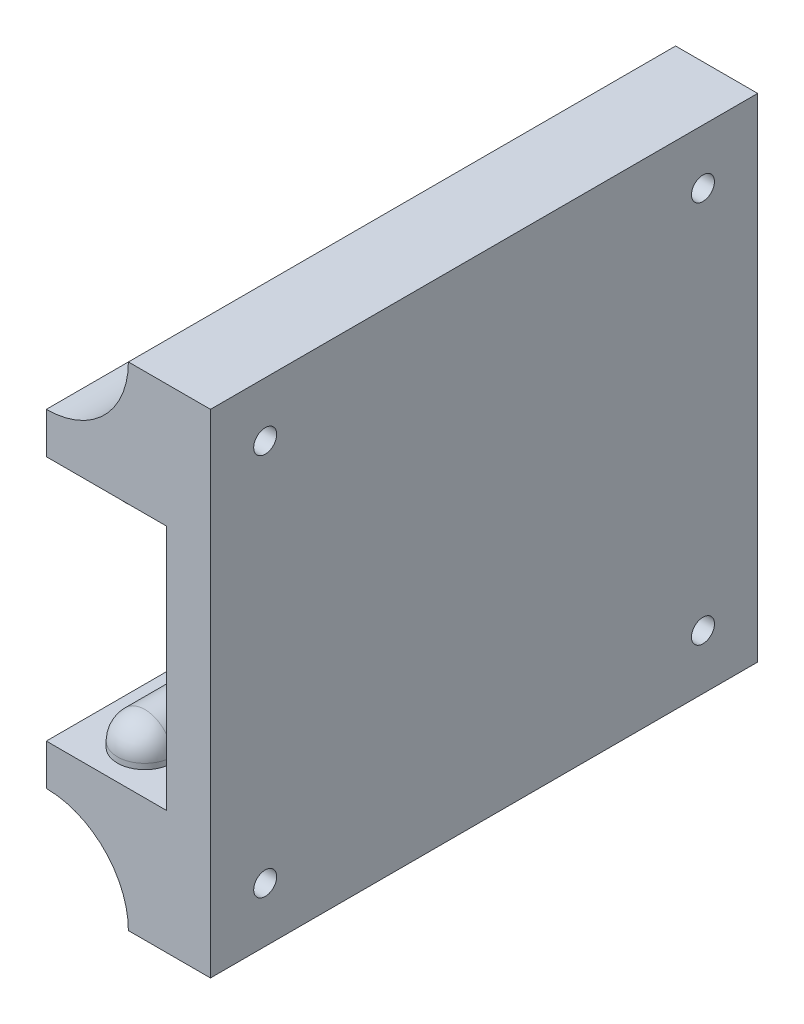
ISO-10303-21;
HEADER;
FILE_DESCRIPTION(('STEP AP214'),'2;1');
FILE_NAME('part.step','',(''),(''),'','','');
FILE_SCHEMA(('AUTOMOTIVE_DESIGN { 1 0 10303 214 1 1 1 1 }'));
ENDSEC;
DATA;
#1=APPLICATION_CONTEXT('core data for automotive mechanical design processes');
#2=APPLICATION_PROTOCOL_DEFINITION('international standard','automotive_design',2000,#1);
#3=PRODUCT_CONTEXT('',#1,'mechanical');
#4=PRODUCT('Part','Part','',(#3));
#5=PRODUCT_RELATED_PRODUCT_CATEGORY('part','',(#4));
#6=PRODUCT_DEFINITION_FORMATION('','',#4);
#7=PRODUCT_DEFINITION_CONTEXT('part definition',#1,'design');
#8=PRODUCT_DEFINITION('design','',#6,#7);
#9=PRODUCT_DEFINITION_SHAPE('','',#8);
#10=(LENGTH_UNIT() NAMED_UNIT(*) SI_UNIT(.MILLI.,.METRE.));
#11=(NAMED_UNIT(*) PLANE_ANGLE_UNIT() SI_UNIT($,.RADIAN.));
#12=(NAMED_UNIT(*) SI_UNIT($,.STERADIAN.) SOLID_ANGLE_UNIT());
#13=UNCERTAINTY_MEASURE_WITH_UNIT(LENGTH_MEASURE(1.E-05),#10,'distance_accuracy_value','');
#14=(GEOMETRIC_REPRESENTATION_CONTEXT(3) GLOBAL_UNCERTAINTY_ASSIGNED_CONTEXT((#13)) GLOBAL_UNIT_ASSIGNED_CONTEXT((#10,
#11,#12)) REPRESENTATION_CONTEXT('',''));
#15=CARTESIAN_POINT('',(0.,0.,0.));
#16=DIRECTION('',(0.,0.,1.));
#17=DIRECTION('',(1.,0.,0.));
#18=AXIS2_PLACEMENT_3D('',#15,#16,#17);
#19=CARTESIAN_POINT('',(0.,21.5000000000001,50.));
#20=DIRECTION('',(0.,0.,-1.));
#21=DIRECTION('',(-1.,0.,0.));
#22=AXIS2_PLACEMENT_3D('',#19,#20,#21);
#23=CYLINDRICAL_SURFACE('',#22,5.);
#24=CARTESIAN_POINT('',(0.,21.5000000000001,42.));
#25=DIRECTION('',(0.,0.707106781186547,-0.707106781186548));
#26=DIRECTION('',(0.,-0.707106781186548,-0.707106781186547));
#27=AXIS2_PLACEMENT_3D('',#24,#25,#26);
#28=ELLIPSE('',#27,7.07106781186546,4.99999999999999);
#29=CARTESIAN_POINT('',(4.99999999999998,21.5000000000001,41.9999999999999));
#30=VERTEX_POINT('',#29);
#31=CARTESIAN_POINT('',(4.89897948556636,22.5,42.9999999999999));
#32=VERTEX_POINT('',#31);
#33=EDGE_CURVE('E537',#30,#32,#28,.F.);
#34=ORIENTED_EDGE('',*,*,#33,.F.);
#35=CARTESIAN_POINT('',(0.,21.5000000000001,42.));
#36=DIRECTION('',(0.,0.,-1.));
#37=DIRECTION('',(1.,0.,0.));
#38=AXIS2_PLACEMENT_3D('',#35,#36,#37);
#39=CIRCLE('',#38,4.99999999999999);
#40=CARTESIAN_POINT('',(-4.99999999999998,21.5000000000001,41.9999999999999));
#41=VERTEX_POINT('',#40);
#42=EDGE_CURVE('E515',#30,#41,#39,.T.);
#43=ORIENTED_EDGE('',*,*,#42,.T.);
#44=CARTESIAN_POINT('',(-4.89897948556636,22.5,42.9999999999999));
#45=VERTEX_POINT('',#44);
#46=EDGE_CURVE('E535',#45,#41,#28,.F.);
#47=ORIENTED_EDGE('',*,*,#46,.F.);
#48=DIRECTION('',(0.,0.,-1.));
#49=VECTOR('',#48,1.);
#50=CARTESIAN_POINT('',(-4.89897948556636,22.5,50.));
#51=LINE('',#50,#49);
#52=CARTESIAN_POINT('',(-4.89897948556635,22.5,-43.));
#53=VERTEX_POINT('',#52);
#54=EDGE_CURVE('E632',#45,#53,#51,.T.);
#55=ORIENTED_EDGE('',*,*,#54,.T.);
#56=CARTESIAN_POINT('',(0.,21.5000000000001,-41.9999999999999));
#57=DIRECTION('',(0.,-0.707106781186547,-0.707106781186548));
#58=DIRECTION('',(0.,0.707106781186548,-0.707106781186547));
#59=AXIS2_PLACEMENT_3D('',#56,#57,#58);
#60=ELLIPSE('',#59,7.07106781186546,4.99999999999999);
#61=CARTESIAN_POINT('',(-4.99999999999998,21.5000000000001,-41.9999999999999));
#62=VERTEX_POINT('',#61);
#63=EDGE_CURVE('E560',#62,#53,#60,.T.);
#64=ORIENTED_EDGE('',*,*,#63,.F.);
#65=CARTESIAN_POINT('',(0.,21.5000000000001,-41.9999999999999));
#66=DIRECTION('',(0.,0.,-1.));
#67=DIRECTION('',(1.,0.,0.));
#68=AXIS2_PLACEMENT_3D('',#65,#66,#67);
#69=CIRCLE('',#68,4.99999999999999);
#70=CARTESIAN_POINT('',(4.99999999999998,21.5000000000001,-41.9999999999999));
#71=VERTEX_POINT('',#70);
#72=EDGE_CURVE('E538',#71,#62,#69,.T.);
#73=ORIENTED_EDGE('',*,*,#72,.F.);
#74=CARTESIAN_POINT('',(4.89897948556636,22.5,-43.));
#75=VERTEX_POINT('',#74);
#76=EDGE_CURVE('E558',#75,#71,#60,.T.);
#77=ORIENTED_EDGE('',*,*,#76,.F.);
#78=DIRECTION('',(0.,0.,-1.));
#79=VECTOR('',#78,1.);
#80=CARTESIAN_POINT('',(4.89897948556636,22.5,50.));
#81=LINE('',#80,#79);
#82=EDGE_CURVE('E630',#32,#75,#81,.T.);
#83=ORIENTED_EDGE('',*,*,#82,.F.);
#84=EDGE_LOOP('',(#34,#43,#47,#55,#64,#73,#77,#83));
#85=FACE_BOUND('',#84,.T.);
#86=ADVANCED_FACE('F348',(#85),#23,.T.);
#87=CARTESIAN_POINT('',(0.,-21.5000000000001,50.));
#88=DIRECTION('',(0.,0.,-1.));
#89=DIRECTION('',(-1.,0.,0.));
#90=AXIS2_PLACEMENT_3D('',#87,#88,#89);
#91=CYLINDRICAL_SURFACE('',#90,5.);
#92=CARTESIAN_POINT('',(0.,-21.5000000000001,42.));
#93=DIRECTION('',(0.,-0.707106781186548,-0.707106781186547));
#94=DIRECTION('',(0.,0.707106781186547,-0.707106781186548));
#95=AXIS2_PLACEMENT_3D('',#92,#93,#94);
#96=ELLIPSE('',#95,7.07106781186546,4.99999999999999);
#97=CARTESIAN_POINT('',(-4.99999999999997,-21.5000000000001,41.9999999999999));
#98=VERTEX_POINT('',#97);
#99=CARTESIAN_POINT('',(-4.89897948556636,-22.5,42.9999999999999));
#100=VERTEX_POINT('',#99);
#101=EDGE_CURVE('E534',#98,#100,#96,.F.);
#102=ORIENTED_EDGE('',*,*,#101,.F.);
#103=CARTESIAN_POINT('',(0.,-21.5000000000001,42.));
#104=DIRECTION('',(0.,0.,-1.));
#105=DIRECTION('',(-1.,0.,0.));
#106=AXIS2_PLACEMENT_3D('',#103,#104,#105);
#107=CIRCLE('',#106,4.99999999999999);
#108=CARTESIAN_POINT('',(4.99999999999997,-21.5000000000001,41.9999999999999));
#109=VERTEX_POINT('',#108);
#110=EDGE_CURVE('E518',#98,#109,#107,.T.);
#111=ORIENTED_EDGE('',*,*,#110,.T.);
#112=CARTESIAN_POINT('',(4.89897948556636,-22.5,42.9999999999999));
#113=VERTEX_POINT('',#112);
#114=EDGE_CURVE('E532',#113,#109,#96,.F.);
#115=ORIENTED_EDGE('',*,*,#114,.F.);
#116=DIRECTION('',(0.,0.,-1.));
#117=VECTOR('',#116,1.);
#118=CARTESIAN_POINT('',(4.89897948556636,-22.5,50.));
#119=LINE('',#118,#117);
#120=CARTESIAN_POINT('',(4.89897948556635,-22.5,-43.));
#121=VERTEX_POINT('',#120);
#122=EDGE_CURVE('E622',#113,#121,#119,.T.);
#123=ORIENTED_EDGE('',*,*,#122,.T.);
#124=CARTESIAN_POINT('',(0.,-21.5000000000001,-41.9999999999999));
#125=DIRECTION('',(0.,0.707106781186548,-0.707106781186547));
#126=DIRECTION('',(0.,-0.707106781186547,-0.707106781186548));
#127=AXIS2_PLACEMENT_3D('',#124,#125,#126);
#128=ELLIPSE('',#127,7.07106781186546,4.99999999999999);
#129=CARTESIAN_POINT('',(4.99999999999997,-21.5000000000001,-41.9999999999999));
#130=VERTEX_POINT('',#129);
#131=EDGE_CURVE('E557',#130,#121,#128,.T.);
#132=ORIENTED_EDGE('',*,*,#131,.F.);
#133=CARTESIAN_POINT('',(0.,-21.5000000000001,-41.9999999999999));
#134=DIRECTION('',(0.,0.,-1.));
#135=DIRECTION('',(-1.,0.,0.));
#136=AXIS2_PLACEMENT_3D('',#133,#134,#135);
#137=CIRCLE('',#136,4.99999999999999);
#138=CARTESIAN_POINT('',(-4.99999999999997,-21.5000000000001,-41.9999999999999));
#139=VERTEX_POINT('',#138);
#140=EDGE_CURVE('E540',#139,#130,#137,.T.);
#141=ORIENTED_EDGE('',*,*,#140,.F.);
#142=CARTESIAN_POINT('',(-4.89897948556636,-22.5,-42.9999999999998));
#143=VERTEX_POINT('',#142);
#144=EDGE_CURVE('E555',#143,#139,#128,.T.);
#145=ORIENTED_EDGE('',*,*,#144,.F.);
#146=DIRECTION('',(0.,0.,-1.));
#147=VECTOR('',#146,1.);
#148=CARTESIAN_POINT('',(-4.89897948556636,-22.5,50.));
#149=LINE('',#148,#147);
#150=EDGE_CURVE('E620',#100,#143,#149,.T.);
#151=ORIENTED_EDGE('',*,*,#150,.F.);
#152=EDGE_LOOP('',(#102,#111,#115,#123,#132,#141,#145,#151));
#153=FACE_BOUND('',#152,.T.);
#154=ADVANCED_FACE('F679',(#153),#91,.T.);
#155=CARTESIAN_POINT('',(-10.,44.9999999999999,50.));
#156=DIRECTION('',(0.,0.,1.));
#157=DIRECTION('',(1.,0.,0.));
#158=AXIS2_PLACEMENT_3D('',#155,#156,#157);
#159=PLANE('',#158);
#160=DIRECTION('',(-1.,0.,0.));
#161=VECTOR('',#160,1.);
#162=CARTESIAN_POINT('',(12.,-22.5,50.));
#163=LINE('',#162,#161);
#164=CARTESIAN_POINT('',(12.,-22.5,50.));
#165=VERTEX_POINT('',#164);
#166=CARTESIAN_POINT('',(-10.,-22.5,50.));
#167=VERTEX_POINT('',#166);
#168=EDGE_CURVE('E593',#165,#167,#163,.T.);
#169=ORIENTED_EDGE('',*,*,#168,.T.);
#170=DIRECTION('',(0.,-1.,0.));
#171=VECTOR('',#170,1.);
#172=CARTESIAN_POINT('',(-9.99999999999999,-30.,50.));
#173=LINE('',#172,#171);
#174=CARTESIAN_POINT('',(-9.99999999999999,-30.,50.));
#175=VERTEX_POINT('',#174);
#176=EDGE_CURVE('E595',#167,#175,#173,.T.);
#177=ORIENTED_EDGE('',*,*,#176,.T.);
#178=CARTESIAN_POINT('',(-10.,-44.9999999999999,50.));
#179=DIRECTION('',(0.,0.,-1.));
#180=DIRECTION('',(-1.,0.,0.));
#181=AXIS2_PLACEMENT_3D('',#178,#179,#180);
#182=CIRCLE('',#181,15.);
#183=CARTESIAN_POINT('',(5.,-44.9999999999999,50.));
#184=VERTEX_POINT('',#183);
#185=EDGE_CURVE('E597',#175,#184,#182,.T.);
#186=ORIENTED_EDGE('',*,*,#185,.T.);
#187=DIRECTION('',(1.,0.,0.));
#188=VECTOR('',#187,1.);
#189=CARTESIAN_POINT('',(20.,-44.9999999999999,50.));
#190=LINE('',#189,#188);
#191=CARTESIAN_POINT('',(20.,-44.9999999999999,50.));
#192=VERTEX_POINT('',#191);
#193=EDGE_CURVE('E599',#184,#192,#190,.T.);
#194=ORIENTED_EDGE('',*,*,#193,.T.);
#195=DIRECTION('',(0.,1.,0.));
#196=VECTOR('',#195,1.);
#197=CARTESIAN_POINT('',(20.,44.9999999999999,50.));
#198=LINE('',#197,#196);
#199=CARTESIAN_POINT('',(20.,44.9999999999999,50.));
#200=VERTEX_POINT('',#199);
#201=EDGE_CURVE('E368',#192,#200,#198,.T.);
#202=ORIENTED_EDGE('',*,*,#201,.T.);
#203=DIRECTION('',(-1.,0.,0.));
#204=VECTOR('',#203,1.);
#205=CARTESIAN_POINT('',(5.,44.9999999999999,50.));
#206=LINE('',#205,#204);
#207=CARTESIAN_POINT('',(5.,44.9999999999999,50.));
#208=VERTEX_POINT('',#207);
#209=EDGE_CURVE('E363',#200,#208,#206,.T.);
#210=ORIENTED_EDGE('',*,*,#209,.T.);
#211=CARTESIAN_POINT('',(-10.,44.9999999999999,50.));
#212=DIRECTION('',(0.,0.,-1.));
#213=DIRECTION('',(1.,0.,0.));
#214=AXIS2_PLACEMENT_3D('',#211,#212,#213);
#215=CIRCLE('',#214,15.);
#216=CARTESIAN_POINT('',(-9.99999999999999,30.,50.));
#217=VERTEX_POINT('',#216);
#218=EDGE_CURVE('E585',#208,#217,#215,.T.);
#219=ORIENTED_EDGE('',*,*,#218,.T.);
#220=DIRECTION('',(0.,-1.,0.));
#221=VECTOR('',#220,1.);
#222=CARTESIAN_POINT('',(-10.,22.5,50.));
#223=LINE('',#222,#221);
#224=CARTESIAN_POINT('',(-10.,22.5,50.));
#225=VERTEX_POINT('',#224);
#226=EDGE_CURVE('E587',#217,#225,#223,.T.);
#227=ORIENTED_EDGE('',*,*,#226,.T.);
#228=DIRECTION('',(1.,0.,0.));
#229=VECTOR('',#228,1.);
#230=CARTESIAN_POINT('',(-4.89897948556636,22.5,50.));
#231=LINE('',#230,#229);
#232=CARTESIAN_POINT('',(12.,22.5,50.));
#233=VERTEX_POINT('',#232);
#234=EDGE_CURVE('E589',#225,#233,#231,.T.);
#235=ORIENTED_EDGE('',*,*,#234,.T.);
#236=DIRECTION('',(0.,-1.,0.));
#237=VECTOR('',#236,1.);
#238=CARTESIAN_POINT('',(12.,22.5,50.));
#239=LINE('',#238,#237);
#240=EDGE_CURVE('E591',#233,#165,#239,.T.);
#241=ORIENTED_EDGE('',*,*,#240,.T.);
#242=EDGE_LOOP('',(#169,#177,#186,#194,#202,#210,#219,#227,#235,#241));
#243=FACE_BOUND('',#242,.T.);
#244=ADVANCED_FACE('F677',(#243),#159,.T.);
#245=CARTESIAN_POINT('',(-10.,44.9999999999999,-49.9999999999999));
#246=DIRECTION('',(0.,0.,1.));
#247=DIRECTION('',(1.,0.,0.));
#248=AXIS2_PLACEMENT_3D('',#245,#246,#247);
#249=PLANE('',#248);
#250=DIRECTION('',(-1.,0.,0.));
#251=VECTOR('',#250,1.);
#252=CARTESIAN_POINT('',(-4.89897948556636,-22.5,-49.9999999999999));
#253=LINE('',#252,#251);
#254=CARTESIAN_POINT('',(12.,-22.5,-49.9999999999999));
#255=VERTEX_POINT('',#254);
#256=CARTESIAN_POINT('',(-10.,-22.5,-49.9999999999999));
#257=VERTEX_POINT('',#256);
#258=EDGE_CURVE('E572',#255,#257,#253,.T.);
#259=ORIENTED_EDGE('',*,*,#258,.F.);
#260=DIRECTION('',(0.,-1.,0.));
#261=VECTOR('',#260,1.);
#262=CARTESIAN_POINT('',(12.,22.5,-49.9999999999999));
#263=LINE('',#262,#261);
#264=CARTESIAN_POINT('',(12.,22.5,-49.9999999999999));
#265=VERTEX_POINT('',#264);
#266=EDGE_CURVE('E569',#265,#255,#263,.T.);
#267=ORIENTED_EDGE('',*,*,#266,.F.);
#268=DIRECTION('',(1.,0.,0.));
#269=VECTOR('',#268,1.);
#270=CARTESIAN_POINT('',(12.,22.5,-49.9999999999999));
#271=LINE('',#270,#269);
#272=CARTESIAN_POINT('',(-10.,22.5,-49.9999999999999));
#273=VERTEX_POINT('',#272);
#274=EDGE_CURVE('E567',#273,#265,#271,.T.);
#275=ORIENTED_EDGE('',*,*,#274,.F.);
#276=DIRECTION('',(0.,-1.,0.));
#277=VECTOR('',#276,1.);
#278=CARTESIAN_POINT('',(-10.,22.5,-49.9999999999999));
#279=LINE('',#278,#277);
#280=CARTESIAN_POINT('',(-9.99999999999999,30.,-49.9999999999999));
#281=VERTEX_POINT('',#280);
#282=EDGE_CURVE('E564',#281,#273,#279,.T.);
#283=ORIENTED_EDGE('',*,*,#282,.F.);
#284=CARTESIAN_POINT('',(-10.,44.9999999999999,-49.9999999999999));
#285=DIRECTION('',(0.,0.,-1.));
#286=DIRECTION('',(1.,0.,0.));
#287=AXIS2_PLACEMENT_3D('',#284,#285,#286);
#288=CIRCLE('',#287,15.);
#289=CARTESIAN_POINT('',(5.,44.9999999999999,-49.9999999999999));
#290=VERTEX_POINT('',#289);
#291=EDGE_CURVE('E561',#290,#281,#288,.T.);
#292=ORIENTED_EDGE('',*,*,#291,.F.);
#293=DIRECTION('',(-1.,0.,0.));
#294=VECTOR('',#293,1.);
#295=CARTESIAN_POINT('',(5.,44.9999999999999,-49.9999999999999));
#296=LINE('',#295,#294);
#297=CARTESIAN_POINT('',(20.,44.9999999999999,-49.9999999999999));
#298=VERTEX_POINT('',#297);
#299=EDGE_CURVE('E583',#298,#290,#296,.T.);
#300=ORIENTED_EDGE('',*,*,#299,.F.);
#301=DIRECTION('',(0.,1.,0.));
#302=VECTOR('',#301,1.);
#303=CARTESIAN_POINT('',(20.,44.9999999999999,-49.9999999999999));
#304=LINE('',#303,#302);
#305=CARTESIAN_POINT('',(20.,-44.9999999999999,-49.9999999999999));
#306=VERTEX_POINT('',#305);
#307=EDGE_CURVE('E581',#306,#298,#304,.T.);
#308=ORIENTED_EDGE('',*,*,#307,.F.);
#309=DIRECTION('',(1.,0.,0.));
#310=VECTOR('',#309,1.);
#311=CARTESIAN_POINT('',(20.,-44.9999999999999,-49.9999999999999));
#312=LINE('',#311,#310);
#313=CARTESIAN_POINT('',(5.,-44.9999999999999,-49.9999999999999));
#314=VERTEX_POINT('',#313);
#315=EDGE_CURVE('E579',#314,#306,#312,.T.);
#316=ORIENTED_EDGE('',*,*,#315,.F.);
#317=CARTESIAN_POINT('',(-10.,-44.9999999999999,-49.9999999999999));
#318=DIRECTION('',(0.,0.,-1.));
#319=DIRECTION('',(-1.,0.,0.));
#320=AXIS2_PLACEMENT_3D('',#317,#318,#319);
#321=CIRCLE('',#320,15.);
#322=CARTESIAN_POINT('',(-9.99999999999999,-30.,-49.9999999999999));
#323=VERTEX_POINT('',#322);
#324=EDGE_CURVE('E577',#323,#314,#321,.T.);
#325=ORIENTED_EDGE('',*,*,#324,.F.);
#326=DIRECTION('',(0.,-1.,0.));
#327=VECTOR('',#326,1.);
#328=CARTESIAN_POINT('',(-9.99999999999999,-30.,-49.9999999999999));
#329=LINE('',#328,#327);
#330=EDGE_CURVE('E575',#257,#323,#329,.T.);
#331=ORIENTED_EDGE('',*,*,#330,.F.);
#332=EDGE_LOOP('',(#259,#267,#275,#283,#292,#300,#308,#316,#325,#331));
#333=FACE_BOUND('',#332,.T.);
#334=ADVANCED_FACE('F642',(#333),#249,.F.);
#335=CARTESIAN_POINT('',(-10.,44.9999999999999,50.));
#336=DIRECTION('',(0.,0.,-1.));
#337=DIRECTION('',(-1.,0.,0.));
#338=AXIS2_PLACEMENT_3D('',#335,#336,#337);
#339=CYLINDRICAL_SURFACE('',#338,15.);
#340=ORIENTED_EDGE('',*,*,#291,.T.);
#341=DIRECTION('',(0.,0.,-1.));
#342=VECTOR('',#341,1.);
#343=CARTESIAN_POINT('',(-9.99999999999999,30.,50.));
#344=LINE('',#343,#342);
#345=EDGE_CURVE('E11',#217,#281,#344,.T.);
#346=ORIENTED_EDGE('',*,*,#345,.F.);
#347=ORIENTED_EDGE('',*,*,#218,.F.);
#348=DIRECTION('',(0.,0.,-1.));
#349=VECTOR('',#348,1.);
#350=CARTESIAN_POINT('',(5.,44.9999999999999,50.));
#351=LINE('',#350,#349);
#352=EDGE_CURVE('E603',#208,#290,#351,.T.);
#353=ORIENTED_EDGE('',*,*,#352,.T.);
#354=EDGE_LOOP('',(#340,#346,#347,#353));
#355=FACE_BOUND('',#354,.T.);
#356=ADVANCED_FACE('F350',(#355),#339,.F.);
#357=CARTESIAN_POINT('',(-10.,22.5,50.));
#358=DIRECTION('',(1.,0.,0.));
#359=DIRECTION('',(0.,1.,0.));
#360=AXIS2_PLACEMENT_3D('',#357,#358,#359);
#361=PLANE('',#360);
#362=ORIENTED_EDGE('',*,*,#282,.T.);
#363=DIRECTION('',(0.,0.,-1.));
#364=VECTOR('',#363,1.);
#365=CARTESIAN_POINT('',(-10.,22.5,50.));
#366=LINE('',#365,#364);
#367=EDGE_CURVE('E356',#225,#273,#366,.T.);
#368=ORIENTED_EDGE('',*,*,#367,.F.);
#369=ORIENTED_EDGE('',*,*,#226,.F.);
#370=ORIENTED_EDGE('',*,*,#345,.T.);
#371=EDGE_LOOP('',(#362,#368,#369,#370));
#372=FACE_BOUND('',#371,.T.);
#373=ADVANCED_FACE('F644',(#372),#361,.F.);
#374=CARTESIAN_POINT('',(12.,22.5,50.));
#375=DIRECTION('',(0.,1.,0.));
#376=DIRECTION('',(-1.,0.,0.));
#377=AXIS2_PLACEMENT_3D('',#374,#375,#376);
#378=PLANE('',#377);
#379=ORIENTED_EDGE('',*,*,#54,.F.);
#380=CARTESIAN_POINT('',(0.,22.5,42.));
#381=DIRECTION('',(0.,-1.,0.));
#382=DIRECTION('',(0.,0.,-1.));
#383=AXIS2_PLACEMENT_3D('',#380,#381,#382);
#384=CIRCLE('',#383,4.99999999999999);
#385=EDGE_CURVE('E524',#32,#45,#384,.T.);
#386=ORIENTED_EDGE('',*,*,#385,.F.);
#387=ORIENTED_EDGE('',*,*,#82,.T.);
#388=CARTESIAN_POINT('',(0.,22.5,-41.9999999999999));
#389=DIRECTION('',(0.,1.,0.));
#390=DIRECTION('',(0.,0.,1.));
#391=AXIS2_PLACEMENT_3D('',#388,#389,#390);
#392=CIRCLE('',#391,4.99999999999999);
#393=EDGE_CURVE('E546',#75,#53,#392,.T.);
#394=ORIENTED_EDGE('',*,*,#393,.T.);
#395=EDGE_LOOP('',(#379,#386,#387,#394));
#396=FACE_BOUND('',#395,.T.);
#397=DIRECTION('',(0.,0.,-1.));
#398=VECTOR('',#397,1.);
#399=CARTESIAN_POINT('',(12.,22.5,50.));
#400=LINE('',#399,#398);
#401=EDGE_CURVE('E627',#233,#265,#400,.T.);
#402=ORIENTED_EDGE('',*,*,#401,.F.);
#403=ORIENTED_EDGE('',*,*,#234,.F.);
#404=ORIENTED_EDGE('',*,*,#367,.T.);
#405=ORIENTED_EDGE('',*,*,#274,.T.);
#406=EDGE_LOOP('',(#402,#403,#404,#405));
#407=FACE_BOUND('',#406,.T.);
#408=ADVANCED_FACE('F638',(#396,#407),#378,.F.);
#409=CARTESIAN_POINT('',(12.,22.5,50.));
#410=DIRECTION('',(1.,0.,0.));
#411=DIRECTION('',(0.,0.,-1.));
#412=AXIS2_PLACEMENT_3D('',#409,#410,#411);
#413=PLANE('',#412);
#414=ORIENTED_EDGE('',*,*,#266,.T.);
#415=DIRECTION('',(0.,0.,-1.));
#416=VECTOR('',#415,1.);
#417=CARTESIAN_POINT('',(12.,-22.5,50.));
#418=LINE('',#417,#416);
#419=EDGE_CURVE('E624',#165,#255,#418,.T.);
#420=ORIENTED_EDGE('',*,*,#419,.F.);
#421=ORIENTED_EDGE('',*,*,#240,.F.);
#422=ORIENTED_EDGE('',*,*,#401,.T.);
#423=EDGE_LOOP('',(#414,#420,#421,#422));
#424=FACE_BOUND('',#423,.T.);
#425=ADVANCED_FACE('F675',(#424),#413,.F.);
#426=CARTESIAN_POINT('',(-4.89897948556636,-22.5,50.));
#427=DIRECTION('',(0.,-1.,0.));
#428=DIRECTION('',(1.,0.,0.));
#429=AXIS2_PLACEMENT_3D('',#426,#427,#428);
#430=PLANE('',#429);
#431=ORIENTED_EDGE('',*,*,#122,.F.);
#432=CARTESIAN_POINT('',(0.,-22.5,42.));
#433=DIRECTION('',(0.,-1.,0.));
#434=DIRECTION('',(0.,0.,-1.));
#435=AXIS2_PLACEMENT_3D('',#432,#433,#434);
#436=CIRCLE('',#435,4.99999999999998);
#437=EDGE_CURVE('E526',#113,#100,#436,.T.);
#438=ORIENTED_EDGE('',*,*,#437,.T.);
#439=ORIENTED_EDGE('',*,*,#150,.T.);
#440=CARTESIAN_POINT('',(0.,-22.5,-41.9999999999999));
#441=DIRECTION('',(0.,1.,0.));
#442=DIRECTION('',(0.,0.,1.));
#443=AXIS2_PLACEMENT_3D('',#440,#441,#442);
#444=CIRCLE('',#443,4.99999999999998);
#445=EDGE_CURVE('E549',#121,#143,#444,.T.);
#446=ORIENTED_EDGE('',*,*,#445,.F.);
#447=EDGE_LOOP('',(#431,#438,#439,#446));
#448=FACE_BOUND('',#447,.T.);
#449=DIRECTION('',(0.,0.,-1.));
#450=VECTOR('',#449,1.);
#451=CARTESIAN_POINT('',(-10.,-22.5,50.));
#452=LINE('',#451,#450);
#453=EDGE_CURVE('E618',#167,#257,#452,.T.);
#454=ORIENTED_EDGE('',*,*,#453,.F.);
#455=ORIENTED_EDGE('',*,*,#168,.F.);
#456=ORIENTED_EDGE('',*,*,#419,.T.);
#457=ORIENTED_EDGE('',*,*,#258,.T.);
#458=EDGE_LOOP('',(#454,#455,#456,#457));
#459=FACE_BOUND('',#458,.T.);
#460=ADVANCED_FACE('F672',(#448,#459),#430,.F.);
#461=CARTESIAN_POINT('',(-9.99999999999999,-30.,50.));
#462=DIRECTION('',(1.,0.,0.));
#463=DIRECTION('',(0.,1.,0.));
#464=AXIS2_PLACEMENT_3D('',#461,#462,#463);
#465=PLANE('',#464);
#466=ORIENTED_EDGE('',*,*,#330,.T.);
#467=DIRECTION('',(0.,0.,-1.));
#468=VECTOR('',#467,1.);
#469=CARTESIAN_POINT('',(-9.99999999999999,-30.,50.));
#470=LINE('',#469,#468);
#471=EDGE_CURVE('E615',#175,#323,#470,.T.);
#472=ORIENTED_EDGE('',*,*,#471,.F.);
#473=ORIENTED_EDGE('',*,*,#176,.F.);
#474=ORIENTED_EDGE('',*,*,#453,.T.);
#475=EDGE_LOOP('',(#466,#472,#473,#474));
#476=FACE_BOUND('',#475,.T.);
#477=ADVANCED_FACE('F668',(#476),#465,.F.);
#478=CARTESIAN_POINT('',(-10.,-44.9999999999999,50.));
#479=DIRECTION('',(0.,0.,-1.));
#480=DIRECTION('',(-1.,0.,0.));
#481=AXIS2_PLACEMENT_3D('',#478,#479,#480);
#482=CYLINDRICAL_SURFACE('',#481,15.);
#483=ORIENTED_EDGE('',*,*,#324,.T.);
#484=DIRECTION('',(0.,0.,-1.));
#485=VECTOR('',#484,1.);
#486=CARTESIAN_POINT('',(5.,-44.9999999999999,50.));
#487=LINE('',#486,#485);
#488=EDGE_CURVE('E612',#184,#314,#487,.T.);
#489=ORIENTED_EDGE('',*,*,#488,.F.);
#490=ORIENTED_EDGE('',*,*,#185,.F.);
#491=ORIENTED_EDGE('',*,*,#471,.T.);
#492=EDGE_LOOP('',(#483,#489,#490,#491));
#493=FACE_BOUND('',#492,.T.);
#494=ADVANCED_FACE('F663',(#493),#482,.F.);
#495=CARTESIAN_POINT('',(20.,-44.9999999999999,50.));
#496=DIRECTION('',(0.,1.,0.));
#497=DIRECTION('',(0.,0.,1.));
#498=AXIS2_PLACEMENT_3D('',#495,#496,#497);
#499=PLANE('',#498);
#500=ORIENTED_EDGE('',*,*,#315,.T.);
#501=DIRECTION('',(0.,0.,-1.));
#502=VECTOR('',#501,1.);
#503=CARTESIAN_POINT('',(20.,-44.9999999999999,50.));
#504=LINE('',#503,#502);
#505=EDGE_CURVE('E609',#192,#306,#504,.T.);
#506=ORIENTED_EDGE('',*,*,#505,.F.);
#507=ORIENTED_EDGE('',*,*,#193,.F.);
#508=ORIENTED_EDGE('',*,*,#488,.T.);
#509=EDGE_LOOP('',(#500,#506,#507,#508));
#510=FACE_BOUND('',#509,.T.);
#511=ADVANCED_FACE('F658',(#510),#499,.F.);
#512=CARTESIAN_POINT('',(20.,44.9999999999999,50.));
#513=DIRECTION('',(-1.,0.,0.));
#514=DIRECTION('',(0.,0.,1.));
#515=AXIS2_PLACEMENT_3D('',#512,#513,#514);
#516=PLANE('',#515);
#517=CARTESIAN_POINT('',(20.,34.9999999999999,-40.));
#518=DIRECTION('',(1.,0.,0.));
#519=DIRECTION('',(0.,0.,-1.));
#520=AXIS2_PLACEMENT_3D('',#517,#518,#519);
#521=CIRCLE('',#520,2.1);
#522=CARTESIAN_POINT('',(20.,34.9999999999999,-42.1));
#523=VERTEX_POINT('',#522);
#524=EDGE_CURVE('E492',#523,#523,#521,.T.);
#525=ORIENTED_EDGE('',*,*,#524,.F.);
#526=EDGE_LOOP('',(#525));
#527=FACE_BOUND('',#526,.T.);
#528=CARTESIAN_POINT('',(20.,-34.9999999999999,-40.));
#529=DIRECTION('',(1.,0.,0.));
#530=DIRECTION('',(0.,0.,-1.));
#531=AXIS2_PLACEMENT_3D('',#528,#529,#530);
#532=CIRCLE('',#531,2.1);
#533=CARTESIAN_POINT('',(20.,-34.9999999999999,-42.1));
#534=VERTEX_POINT('',#533);
#535=EDGE_CURVE('E500',#534,#534,#532,.T.);
#536=ORIENTED_EDGE('',*,*,#535,.F.);
#537=EDGE_LOOP('',(#536));
#538=FACE_BOUND('',#537,.T.);
#539=CARTESIAN_POINT('',(20.,-34.9999999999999,40.));
#540=DIRECTION('',(1.,0.,0.));
#541=DIRECTION('',(0.,0.,-1.));
#542=AXIS2_PLACEMENT_3D('',#539,#540,#541);
#543=CIRCLE('',#542,2.1);
#544=CARTESIAN_POINT('',(20.,-34.9999999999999,37.9));
#545=VERTEX_POINT('',#544);
#546=EDGE_CURVE('E506',#545,#545,#543,.T.);
#547=ORIENTED_EDGE('',*,*,#546,.F.);
#548=EDGE_LOOP('',(#547));
#549=FACE_BOUND('',#548,.T.);
#550=CARTESIAN_POINT('',(20.,34.9999999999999,40.));
#551=DIRECTION('',(1.,0.,0.));
#552=DIRECTION('',(0.,0.,-1.));
#553=AXIS2_PLACEMENT_3D('',#550,#551,#552);
#554=CIRCLE('',#553,2.1);
#555=CARTESIAN_POINT('',(20.,34.9999999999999,37.9));
#556=VERTEX_POINT('',#555);
#557=EDGE_CURVE('E512',#556,#556,#554,.T.);
#558=ORIENTED_EDGE('',*,*,#557,.F.);
#559=EDGE_LOOP('',(#558));
#560=FACE_BOUND('',#559,.T.);
#561=ORIENTED_EDGE('',*,*,#307,.T.);
#562=DIRECTION('',(0.,0.,-1.));
#563=VECTOR('',#562,1.);
#564=CARTESIAN_POINT('',(20.,44.9999999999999,50.));
#565=LINE('',#564,#563);
#566=EDGE_CURVE('E606',#200,#298,#565,.T.);
#567=ORIENTED_EDGE('',*,*,#566,.F.);
#568=ORIENTED_EDGE('',*,*,#201,.F.);
#569=ORIENTED_EDGE('',*,*,#505,.T.);
#570=EDGE_LOOP('',(#561,#567,#568,#569));
#571=FACE_BOUND('',#570,.T.);
#572=ADVANCED_FACE('F654',(#527,#538,#549,#560,#571),#516,.F.);
#573=CARTESIAN_POINT('',(5.,44.9999999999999,50.));
#574=DIRECTION('',(0.,-1.,0.));
#575=DIRECTION('',(0.,0.,-1.));
#576=AXIS2_PLACEMENT_3D('',#573,#574,#575);
#577=PLANE('',#576);
#578=ORIENTED_EDGE('',*,*,#299,.T.);
#579=ORIENTED_EDGE('',*,*,#352,.F.);
#580=ORIENTED_EDGE('',*,*,#209,.F.);
#581=ORIENTED_EDGE('',*,*,#566,.T.);
#582=EDGE_LOOP('',(#578,#579,#580,#581));
#583=FACE_BOUND('',#582,.T.);
#584=ADVANCED_FACE('F652',(#583),#577,.F.);
#585=CARTESIAN_POINT('',(0.,21.5000000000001,-41.9999999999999));
#586=DIRECTION('',(0.,1.,0.));
#587=DIRECTION('',(1.,0.,0.));
#588=AXIS2_PLACEMENT_3D('',#585,#586,#587);
#589=SPHERICAL_SURFACE('',#588,4.99999999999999);
#590=CARTESIAN_POINT('',(0.,21.5000000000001,-41.9999999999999));
#591=DIRECTION('',(0.,1.,0.));
#592=DIRECTION('',(0.,0.,1.));
#593=AXIS2_PLACEMENT_3D('',#590,#591,#592);
#594=CIRCLE('',#593,4.99999999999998);
#595=EDGE_CURVE('E543',#71,#62,#594,.T.);
#596=ORIENTED_EDGE('',*,*,#595,.F.);
#597=ORIENTED_EDGE('',*,*,#72,.T.);
#598=EDGE_LOOP('',(#596,#597));
#599=FACE_BOUND('',#598,.T.);
#600=ADVANCED_FACE('F718',(#599),#589,.T.);
#601=CARTESIAN_POINT('',(0.,26.7779993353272,-41.9999999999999));
#602=DIRECTION('',(0.,1.,0.));
#603=DIRECTION('',(0.,0.,1.));
#604=AXIS2_PLACEMENT_3D('',#601,#602,#603);
#605=CYLINDRICAL_SURFACE('',#604,4.99999999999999);
#606=ORIENTED_EDGE('',*,*,#63,.T.);
#607=ORIENTED_EDGE('',*,*,#393,.F.);
#608=ORIENTED_EDGE('',*,*,#76,.T.);
#609=ORIENTED_EDGE('',*,*,#595,.T.);
#610=EDGE_LOOP('',(#606,#607,#608,#609));
#611=FACE_BOUND('',#610,.T.);
#612=ADVANCED_FACE('F722',(#611),#605,.T.);
#613=CARTESIAN_POINT('',(0.,26.7779993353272,-41.9999999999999));
#614=DIRECTION('',(0.,1.,0.));
#615=DIRECTION('',(0.,0.,1.));
#616=AXIS2_PLACEMENT_3D('',#613,#614,#615);
#617=CYLINDRICAL_SURFACE('',#616,4.99999999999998);
#618=ORIENTED_EDGE('',*,*,#131,.T.);
#619=ORIENTED_EDGE('',*,*,#445,.T.);
#620=ORIENTED_EDGE('',*,*,#144,.T.);
#621=CARTESIAN_POINT('',(0.,-21.5000000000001,-41.9999999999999));
#622=DIRECTION('',(0.,1.,0.));
#623=DIRECTION('',(0.,0.,1.));
#624=AXIS2_PLACEMENT_3D('',#621,#622,#623);
#625=CIRCLE('',#624,4.99999999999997);
#626=EDGE_CURVE('E552',#130,#139,#625,.T.);
#627=ORIENTED_EDGE('',*,*,#626,.F.);
#628=EDGE_LOOP('',(#618,#619,#620,#627));
#629=FACE_BOUND('',#628,.T.);
#630=ADVANCED_FACE('F783',(#629),#617,.T.);
#631=CARTESIAN_POINT('',(0.,-21.5000000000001,-41.9999999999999));
#632=DIRECTION('',(0.,1.,0.));
#633=DIRECTION('',(1.,0.,0.));
#634=AXIS2_PLACEMENT_3D('',#631,#632,#633);
#635=SPHERICAL_SURFACE('',#634,4.99999999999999);
#636=ORIENTED_EDGE('',*,*,#626,.T.);
#637=ORIENTED_EDGE('',*,*,#140,.T.);
#638=EDGE_LOOP('',(#636,#637));
#639=FACE_BOUND('',#638,.T.);
#640=ADVANCED_FACE('F759',(#639),#635,.T.);
#641=CARTESIAN_POINT('',(0.,21.5000000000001,42.));
#642=DIRECTION('',(0.,1.,0.));
#643=DIRECTION('',(1.,0.,0.));
#644=AXIS2_PLACEMENT_3D('',#641,#642,#643);
#645=SPHERICAL_SURFACE('',#644,4.99999999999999);
#646=ORIENTED_EDGE('',*,*,#42,.F.);
#647=CARTESIAN_POINT('',(0.,21.5000000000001,42.));
#648=DIRECTION('',(0.,-1.,0.));
#649=DIRECTION('',(0.,0.,-1.));
#650=AXIS2_PLACEMENT_3D('',#647,#648,#649);
#651=CIRCLE('',#650,4.99999999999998);
#652=EDGE_CURVE('E521',#30,#41,#651,.T.);
#653=ORIENTED_EDGE('',*,*,#652,.T.);
#654=EDGE_LOOP('',(#646,#653));
#655=FACE_BOUND('',#654,.T.);
#656=ADVANCED_FACE('F754',(#655),#645,.T.);
#657=CARTESIAN_POINT('',(0.,26.7779993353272,42.));
#658=DIRECTION('',(0.,1.,0.));
#659=DIRECTION('',(0.,0.,-1.));
#660=AXIS2_PLACEMENT_3D('',#657,#658,#659);
#661=CYLINDRICAL_SURFACE('',#660,4.99999999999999);
#662=ORIENTED_EDGE('',*,*,#33,.T.);
#663=ORIENTED_EDGE('',*,*,#385,.T.);
#664=ORIENTED_EDGE('',*,*,#46,.T.);
#665=ORIENTED_EDGE('',*,*,#652,.F.);
#666=EDGE_LOOP('',(#662,#663,#664,#665));
#667=FACE_BOUND('',#666,.T.);
#668=ADVANCED_FACE('F758',(#667),#661,.T.);
#669=CARTESIAN_POINT('',(0.,26.7779993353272,42.));
#670=DIRECTION('',(0.,1.,0.));
#671=DIRECTION('',(0.,0.,-1.));
#672=AXIS2_PLACEMENT_3D('',#669,#670,#671);
#673=CYLINDRICAL_SURFACE('',#672,4.99999999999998);
#674=ORIENTED_EDGE('',*,*,#101,.T.);
#675=ORIENTED_EDGE('',*,*,#437,.F.);
#676=ORIENTED_EDGE('',*,*,#114,.T.);
#677=CARTESIAN_POINT('',(0.,-21.5000000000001,42.));
#678=DIRECTION('',(0.,-1.,0.));
#679=DIRECTION('',(0.,0.,-1.));
#680=AXIS2_PLACEMENT_3D('',#677,#678,#679);
#681=CIRCLE('',#680,4.99999999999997);
#682=EDGE_CURVE('E529',#109,#98,#681,.T.);
#683=ORIENTED_EDGE('',*,*,#682,.T.);
#684=EDGE_LOOP('',(#674,#675,#676,#683));
#685=FACE_BOUND('',#684,.T.);
#686=ADVANCED_FACE('F765',(#685),#673,.T.);
#687=CARTESIAN_POINT('',(0.,-21.5000000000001,42.));
#688=DIRECTION('',(0.,1.,0.));
#689=DIRECTION('',(1.,0.,0.));
#690=AXIS2_PLACEMENT_3D('',#687,#688,#689);
#691=SPHERICAL_SURFACE('',#690,4.99999999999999);
#692=ORIENTED_EDGE('',*,*,#682,.F.);
#693=ORIENTED_EDGE('',*,*,#110,.F.);
#694=EDGE_LOOP('',(#692,#693));
#695=FACE_BOUND('',#694,.T.);
#696=ADVANCED_FACE('F771',(#695),#691,.T.);
#697=CARTESIAN_POINT('',(20.,34.9999999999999,40.));
#698=DIRECTION('',(1.,0.,0.));
#699=DIRECTION('',(0.,0.,-1.));
#700=AXIS2_PLACEMENT_3D('',#697,#698,#699);
#701=CYLINDRICAL_SURFACE('',#700,2.1);
#702=CARTESIAN_POINT('',(6.00000000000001,34.9999999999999,40.));
#703=DIRECTION('',(1.,0.,0.));
#704=DIRECTION('',(0.,0.,-1.));
#705=AXIS2_PLACEMENT_3D('',#702,#703,#704);
#706=CIRCLE('',#705,2.1);
#707=CARTESIAN_POINT('',(6.00000000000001,34.9999999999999,37.9));
#708=VERTEX_POINT('',#707);
#709=EDGE_CURVE('E509',#708,#708,#706,.T.);
#710=ORIENTED_EDGE('',*,*,#709,.F.);
#711=EDGE_LOOP('',(#710));
#712=FACE_BOUND('',#711,.T.);
#713=ORIENTED_EDGE('',*,*,#557,.T.);
#714=EDGE_LOOP('',(#713));
#715=FACE_BOUND('',#714,.T.);
#716=ADVANCED_FACE('F777',(#712,#715),#701,.F.);
#717=CARTESIAN_POINT('',(6.00000000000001,34.9999999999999,40.));
#718=DIRECTION('',(1.,0.,0.));
#719=DIRECTION('',(0.,0.,-1.));
#720=AXIS2_PLACEMENT_3D('',#717,#718,#719);
#721=CONICAL_SURFACE('',#720,2.1,1.02974425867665);
#722=CARTESIAN_POINT('',(4.73819270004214,34.9999999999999,40.));
#723=VERTEX_POINT('',#722);
#724=VERTEX_LOOP('',#723);
#725=FACE_BOUND('',#724,.T.);
#726=ORIENTED_EDGE('',*,*,#709,.T.);
#727=EDGE_LOOP('',(#726));
#728=FACE_BOUND('',#727,.T.);
#729=ADVANCED_FACE('F800',(#725,#728),#721,.F.);
#730=CARTESIAN_POINT('',(20.,-34.9999999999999,40.));
#731=DIRECTION('',(1.,0.,0.));
#732=DIRECTION('',(0.,0.,-1.));
#733=AXIS2_PLACEMENT_3D('',#730,#731,#732);
#734=CYLINDRICAL_SURFACE('',#733,2.1);
#735=CARTESIAN_POINT('',(6.00000000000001,-34.9999999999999,40.));
#736=DIRECTION('',(1.,0.,0.));
#737=DIRECTION('',(0.,0.,-1.));
#738=AXIS2_PLACEMENT_3D('',#735,#736,#737);
#739=CIRCLE('',#738,2.1);
#740=CARTESIAN_POINT('',(6.00000000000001,-34.9999999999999,37.9));
#741=VERTEX_POINT('',#740);
#742=EDGE_CURVE('E503',#741,#741,#739,.T.);
#743=ORIENTED_EDGE('',*,*,#742,.F.);
#744=EDGE_LOOP('',(#743));
#745=FACE_BOUND('',#744,.T.);
#746=ORIENTED_EDGE('',*,*,#546,.T.);
#747=EDGE_LOOP('',(#746));
#748=FACE_BOUND('',#747,.T.);
#749=ADVANCED_FACE('F808',(#745,#748),#734,.F.);
#750=CARTESIAN_POINT('',(6.00000000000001,-34.9999999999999,40.));
#751=DIRECTION('',(1.,0.,0.));
#752=DIRECTION('',(0.,0.,-1.));
#753=AXIS2_PLACEMENT_3D('',#750,#751,#752);
#754=CONICAL_SURFACE('',#753,2.1,1.02974425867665);
#755=CARTESIAN_POINT('',(4.73819270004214,-34.9999999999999,40.));
#756=VERTEX_POINT('',#755);
#757=VERTEX_LOOP('',#756);
#758=FACE_BOUND('',#757,.T.);
#759=ORIENTED_EDGE('',*,*,#742,.T.);
#760=EDGE_LOOP('',(#759));
#761=FACE_BOUND('',#760,.T.);
#762=ADVANCED_FACE('F814',(#758,#761),#754,.F.);
#763=CARTESIAN_POINT('',(20.,-34.9999999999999,-40.));
#764=DIRECTION('',(1.,0.,0.));
#765=DIRECTION('',(0.,0.,-1.));
#766=AXIS2_PLACEMENT_3D('',#763,#764,#765);
#767=CYLINDRICAL_SURFACE('',#766,2.1);
#768=CARTESIAN_POINT('',(6.00000000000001,-34.9999999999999,-40.));
#769=DIRECTION('',(1.,0.,0.));
#770=DIRECTION('',(0.,0.,-1.));
#771=AXIS2_PLACEMENT_3D('',#768,#769,#770);
#772=CIRCLE('',#771,2.1);
#773=CARTESIAN_POINT('',(6.00000000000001,-34.9999999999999,-42.1));
#774=VERTEX_POINT('',#773);
#775=EDGE_CURVE('E495',#774,#774,#772,.T.);
#776=ORIENTED_EDGE('',*,*,#775,.F.);
#777=EDGE_LOOP('',(#776));
#778=FACE_BOUND('',#777,.T.);
#779=ORIENTED_EDGE('',*,*,#535,.T.);
#780=EDGE_LOOP('',(#779));
#781=FACE_BOUND('',#780,.T.);
#782=ADVANCED_FACE('F822',(#778,#781),#767,.F.);
#783=CARTESIAN_POINT('',(6.00000000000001,-34.9999999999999,-40.));
#784=DIRECTION('',(1.,0.,0.));
#785=DIRECTION('',(0.,0.,-1.));
#786=AXIS2_PLACEMENT_3D('',#783,#784,#785);
#787=CONICAL_SURFACE('',#786,2.1,1.02974425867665);
#788=CARTESIAN_POINT('',(4.73819270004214,-34.9999999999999,-40.));
#789=VERTEX_POINT('',#788);
#790=VERTEX_LOOP('',#789);
#791=FACE_BOUND('',#790,.T.);
#792=ORIENTED_EDGE('',*,*,#775,.T.);
#793=EDGE_LOOP('',(#792));
#794=FACE_BOUND('',#793,.T.);
#795=ADVANCED_FACE('F828',(#791,#794),#787,.F.);
#796=CARTESIAN_POINT('',(20.,34.9999999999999,-40.));
#797=DIRECTION('',(1.,0.,0.));
#798=DIRECTION('',(0.,0.,-1.));
#799=AXIS2_PLACEMENT_3D('',#796,#797,#798);
#800=CYLINDRICAL_SURFACE('',#799,2.1);
#801=CARTESIAN_POINT('',(6.00000000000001,34.9999999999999,-40.));
#802=DIRECTION('',(1.,0.,0.));
#803=DIRECTION('',(0.,0.,-1.));
#804=AXIS2_PLACEMENT_3D('',#801,#802,#803);
#805=CIRCLE('',#804,2.1);
#806=CARTESIAN_POINT('',(6.00000000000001,34.9999999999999,-42.1));
#807=VERTEX_POINT('',#806);
#808=EDGE_CURVE('E490',#807,#807,#805,.T.);
#809=ORIENTED_EDGE('',*,*,#808,.F.);
#810=EDGE_LOOP('',(#809));
#811=FACE_BOUND('',#810,.T.);
#812=ORIENTED_EDGE('',*,*,#524,.T.);
#813=EDGE_LOOP('',(#812));
#814=FACE_BOUND('',#813,.T.);
#815=ADVANCED_FACE('F486',(#811,#814),#800,.F.);
#816=CARTESIAN_POINT('',(6.00000000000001,34.9999999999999,-40.));
#817=DIRECTION('',(1.,0.,0.));
#818=DIRECTION('',(0.,0.,-1.));
#819=AXIS2_PLACEMENT_3D('',#816,#817,#818);
#820=CONICAL_SURFACE('',#819,2.1,1.02974425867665);
#821=CARTESIAN_POINT('',(4.73819270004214,34.9999999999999,-40.));
#822=VERTEX_POINT('',#821);
#823=VERTEX_LOOP('',#822);
#824=FACE_BOUND('',#823,.T.);
#825=ORIENTED_EDGE('',*,*,#808,.T.);
#826=EDGE_LOOP('',(#825));
#827=FACE_BOUND('',#826,.T.);
#828=ADVANCED_FACE('F483',(#824,#827),#820,.F.);
#829=CLOSED_SHELL('',(#86,#154,#244,#334,#356,#373,#408,#425,#460,#477,#494,#511,#572,#584,#600,
#612,#630,#640,#656,#668,#686,#696,#716,#729,#749,#762,#782,#795,#815,#828));
#830=MANIFOLD_SOLID_BREP('B2',#829);
#831=ADVANCED_BREP_SHAPE_REPRESENTATION('',(#18,#830),#14);
#832=SHAPE_DEFINITION_REPRESENTATION(#9,#831);
ENDSEC;
END-ISO-10303-21;
